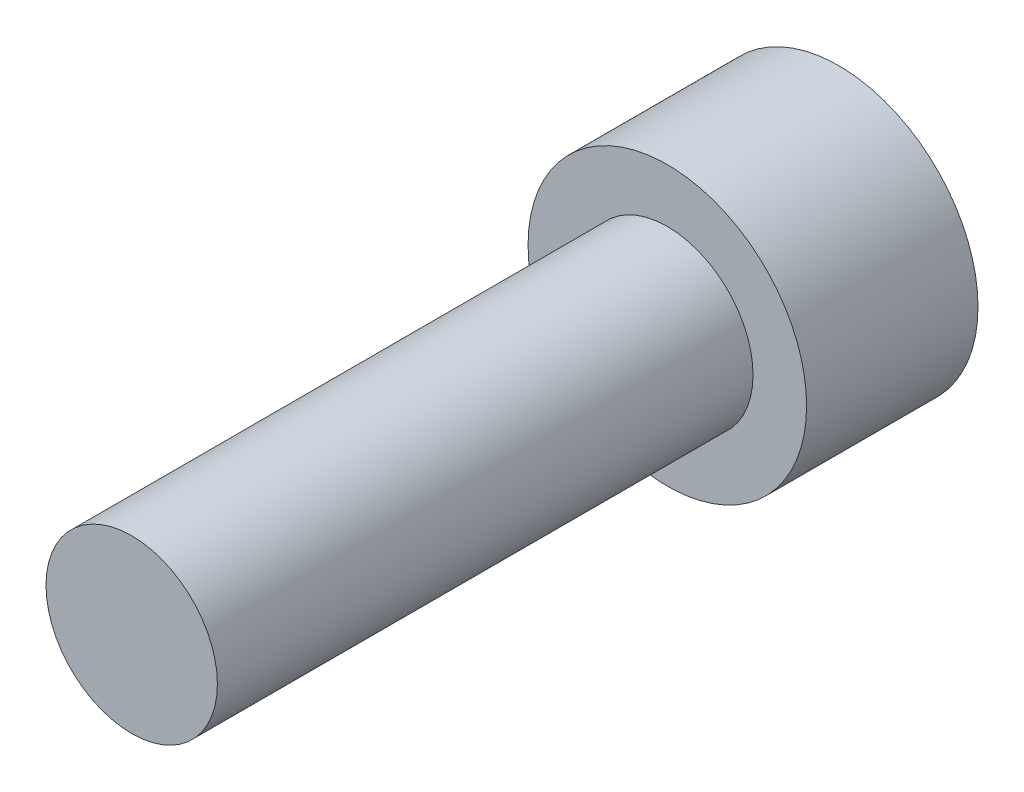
from build123d import *

# Parameters (mm, degrees)
SKETCH_1_R          = 6.5
EXTRUDE_1_DEPTH     = 8
SKETCH_2_R          = 4
EXTRUDE_2_DEPTH     = 25
CUT_EXTRUDE_1_DEPTH = 7.5


with BuildPart() as part:
    # Sketch 1 → Extrude 1 (new body)
    with BuildSketch(Plane.XY):
        Circle(SKETCH_1_R)
    extrude(amount=EXTRUDE_1_DEPTH)

    # Sketch 2 → Extrude 2 (add)
    with BuildSketch(Plane.XY.offset(8)):
        Circle(SKETCH_2_R)
    extrude(amount=EXTRUDE_2_DEPTH)

    # Sketch 3 → Cut-Extrude 1 (cut)
    with BuildSketch(Plane(origin=(0, 0, 0), x_dir=(-1, 0, 0), z_dir=(0, 0, -1))):
        Polygon((3.251663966, 3.280246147), (-1.214944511, 4.456146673), (-4.466608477, 1.175900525), (-3.251663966, -3.280246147), (1.214944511, -4.456146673), (4.466608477, -1.175900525), align=None)
    extrude(amount=-CUT_EXTRUDE_1_DEPTH, mode=Mode.SUBTRACT)


solid = part.part
